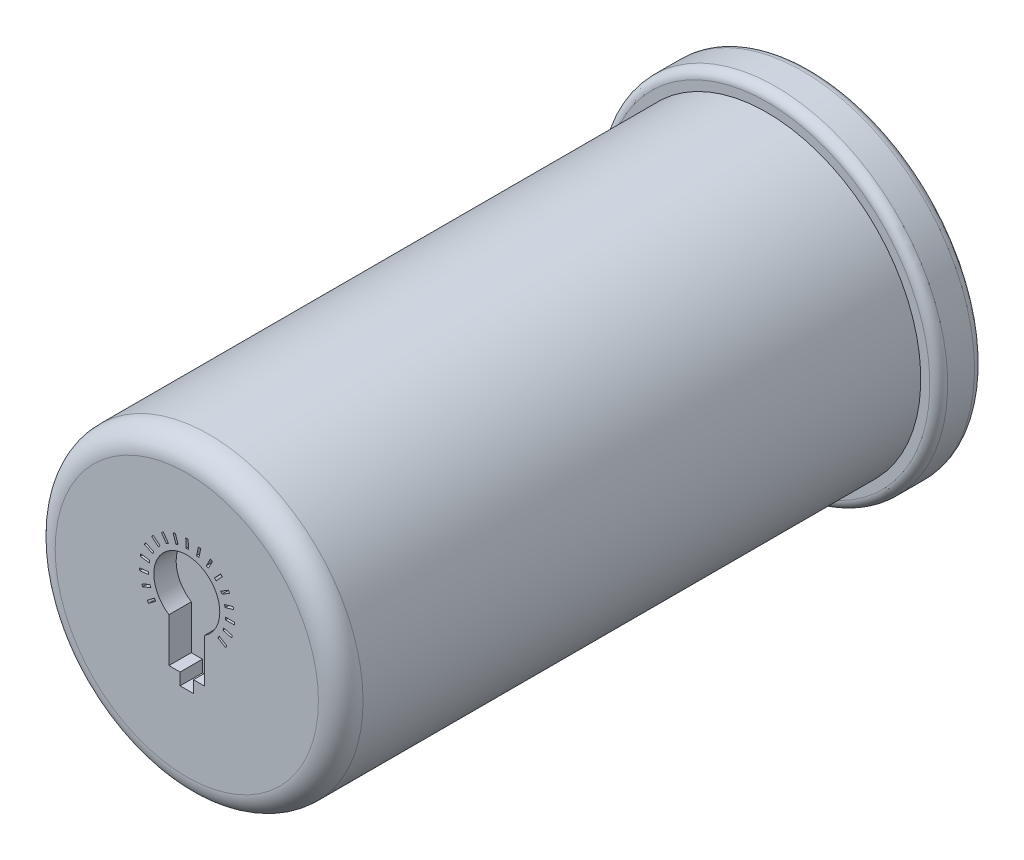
from build123d import *

# Parameters (mm, degrees)
ESQUISSE1_R             = 3.45
EXTRUSION1_DEPTH        = 13
CONG_1_R                = 0.5
ENL_V_MAT_EXTRU_1_DEPTH = 0.5
ESQUISSE3_R             = 3.853165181
EXTRUSION2_DEPTH        = 1
CONG_2_R                = 0.2


with BuildPart() as part:
    # Esquisse1 → Extrusion1 (new body)
    with BuildSketch(Plane.XY):
        with Locations(Location((0, 0, 0), (0, 0, 180))):
            Circle(ESQUISSE1_R)
    extrude(amount=EXTRUSION1_DEPTH)

    # Cong_1
    cong_1_edges = [part.edges().sort_by_distance(p)[0] for p in [
        (3.45, 0, 13),
    ]]
    fillet(cong_1_edges, radius=CONG_1_R)

    # Esquisse2 → Enl_v. mat.-Extru.1 (cut)
    with BuildSketch(Plane.XY.offset(13)):
        Polygon((0.897284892, 0.043728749), (0.86962377, -0.00230709), (0.698190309, 0.100700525), (0.725851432, 0.146736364), align=None)
        Polygon((1.019186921, 0.304193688), (1.004890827, 0.252424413), (0.812106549, 0.305661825), (0.826402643, 0.3574311), align=None)
        with BuildLine():
            Line((-0.4, -0.986865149), (-0.15, -0.986865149))
            Line((-0.15, -0.986865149), (-0.15, -1.255399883))
            Line((-0.15, -1.255399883), (0.15, -1.255399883))
            Line((0.15, -1.255399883), (0.15, -0.986865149))
            Line((0.15, -0.986865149), (0.4, -0.986865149))
            Line((0.4, -0.986865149), (0.4, 0))
            ThreePointArc((0.4, 0), (0, 1.360079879), (-0.4, 0))
            Line((-0.4, 0), (-0.4, -0.986865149))
        make_face()
        Polygon((1.066739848, 0.587814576), (1.066857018, 0.534107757), (0.866857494, 0.533671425), (0.866740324, 0.587378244), align=None)
        Polygon((1.036456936, 0.873795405), (1.050978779, 0.822089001), (0.858428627, 0.768010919), (0.843906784, 0.819717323), align=None)
        Polygon((0.930558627, 1.141167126), (0.958420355, 1.09525242), (0.787437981, 0.991497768), (0.759576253, 1.037412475), align=None)
        Polygon((0.756809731, 1.370325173), (0.79596843, 1.33356878), (0.65909082, 1.187745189), (0.61993212, 1.224501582), align=None)
        Polygon((0.527950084, 1.544466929), (0.575534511, 1.519563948), (0.482797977, 1.34236368), (0.43521355, 1.36726666), align=None)
        Polygon((0.260760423, 1.650823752), (0.313281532, 1.639600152), (0.27148582, 1.444016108), (0.21896471, 1.455239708), align=None)
        Polygon((-0.025168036, 1.681597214), (0.028438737, 1.684875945), (0.040648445, 1.485248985), (-0.012958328, 1.481970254), align=None)
        Polygon((-0.308870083, 1.634530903), (-0.258108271, 1.652071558), (-0.192788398, 1.463038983), (-0.243550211, 1.445498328), align=None)
        Polygon((-0.569543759, 1.513075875), (-0.525348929, 1.543592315), (-0.411708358, 1.379014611), (-0.455903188, 1.348498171), align=None)
        Polygon((-0.788075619, 1.326137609), (-0.75368828, 1.36739227), (-0.600059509, 1.239336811), (-0.634446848, 1.198082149), align=None)
        Polygon((-0.948442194, 1.087423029), (-0.926383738, 1.136390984), (-0.744031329, 1.054247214), (-0.766089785, 1.005279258), align=None)
        Polygon((-1.038884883, 0.814435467), (-1.030772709, 0.867526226), (-0.833067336, 0.837317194), (-0.84117951, 0.784226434), align=None)
        Polygon((-1.052772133, 0.527191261), (-1.059201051, 0.580512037), (-0.860639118, 0.604452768), (-0.8542102, 0.551131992), align=None)
        Polygon((-0.989085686, 0.246752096), (-1.009584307, 0.296393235), (-0.824725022, 0.372728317), (-0.804226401, 0.323087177), align=None)
        Polygon((-0.85249524, -0.006319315), (-0.885560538, 0.036002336), (-0.727958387, 0.159134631), (-0.694893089, 0.11681298), align=None)
    extrude(amount=-ENL_V_MAT_EXTRU_1_DEPTH, mode=Mode.SUBTRACT)

    # Esquisse3 → Extrusion2 (add)
    with BuildSketch(Plane(origin=(0, 0, 0), x_dir=(-1, 0, 0), z_dir=(0, 0, -1))):
        Circle(ESQUISSE3_R)
    extrude(amount=EXTRUSION2_DEPTH)

    # Cong_2
    cong_2_edges = [part.edges().sort_by_distance(p)[0] for p in [
        (3.853165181, 0, 0),
        (3.853165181, 0, -1),
    ]]
    fillet(cong_2_edges, radius=CONG_2_R)


solid = part.part
